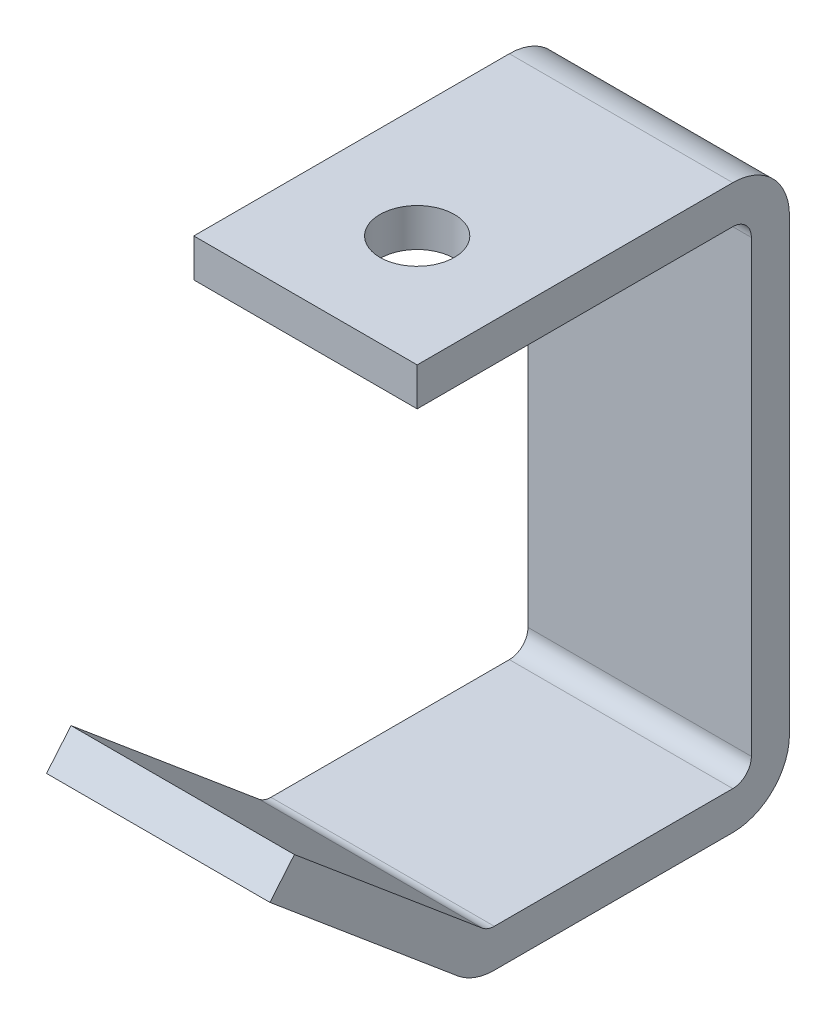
from build123d import *

# Parameters (mm, degrees)
BASE_EXTRUDE_THIN_DEPTH = 19.05
CUT_EXTRUDE1_REACH      = 129.759
SKETCH2_R               = 6.35


with BuildPart() as part:
    # Sketch1 → Base-Extrude-Thin (new, symmetric)
    with BuildSketch(Plane(origin=(0, 0, 0), x_dir=(0, 0, -1), z_dir=(1, 0, 0))):
        with BuildLine():
            Line((-77.939911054, 27.639867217), (-45.885245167, 0.742808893))
            ThreePointArc((-45.885245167, 0.742808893), (-44.930308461, 0.191475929), (-43.844394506, 0))
            Line((-43.844394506, 0), (-3.175, 0))
            ThreePointArc((-3.175, 0), (-0.92993597, 0.92993597), (0, 3.175))
            Line((0, 3.175), (0, 79.825))
            ThreePointArc((0, 79.825), (-0.92993597, 82.07006403), (-3.175, 83))
            Line((-3.175, 83), (-57, 83))
            Line((-57, 83), (-57, 89.5))
            Line((-57, 89.5), (-3.175, 89.5))
            ThreePointArc((-3.175, 89.5), (3.666258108, 86.666258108), (6.5, 79.825))
            Line((6.5, 79.825), (6.5, 3.175))
            ThreePointArc((6.5, 3.175), (3.666258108, -3.666258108), (-3.175, -6.5))
            Line((-3.175, -6.5), (-43.844394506, -6.5))
            ThreePointArc((-43.844394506, -6.5), (-47.153439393, -5.916526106), (-50.06336463, -4.236479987))
            Line((-50.06336463, -4.236479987), (-82.118030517, 22.660578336))
            Line((-82.118030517, 22.660578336), (-77.939911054, 27.639867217))
        make_face()
    extrude(amount=BASE_EXTRUDE_THIN_DEPTH, both=True)

    # Sketch2 → Cut-Extrude1 (cut, up to next)
    with BuildSketch(Plane(origin=(0, 89.5, 0), x_dir=(-1, 0, 0), z_dir=(0, 1, 0)), mode=Mode.PRIVATE) as cut_extrude1_sk1:
        with Locations(Location((0, 37.95, 0), (0, 0, 90))):
            Circle(SKETCH2_R)
    cut_extrude1_tool1 = extrude(cut_extrude1_sk1.sketch, amount=-CUT_EXTRUDE1_REACH, mode=Mode.PRIVATE) & part.part
    add(cut_extrude1_tool1.solids().sort_by_distance((0, 89.5, 37.95))[0], mode=Mode.SUBTRACT)


solid = part.part
